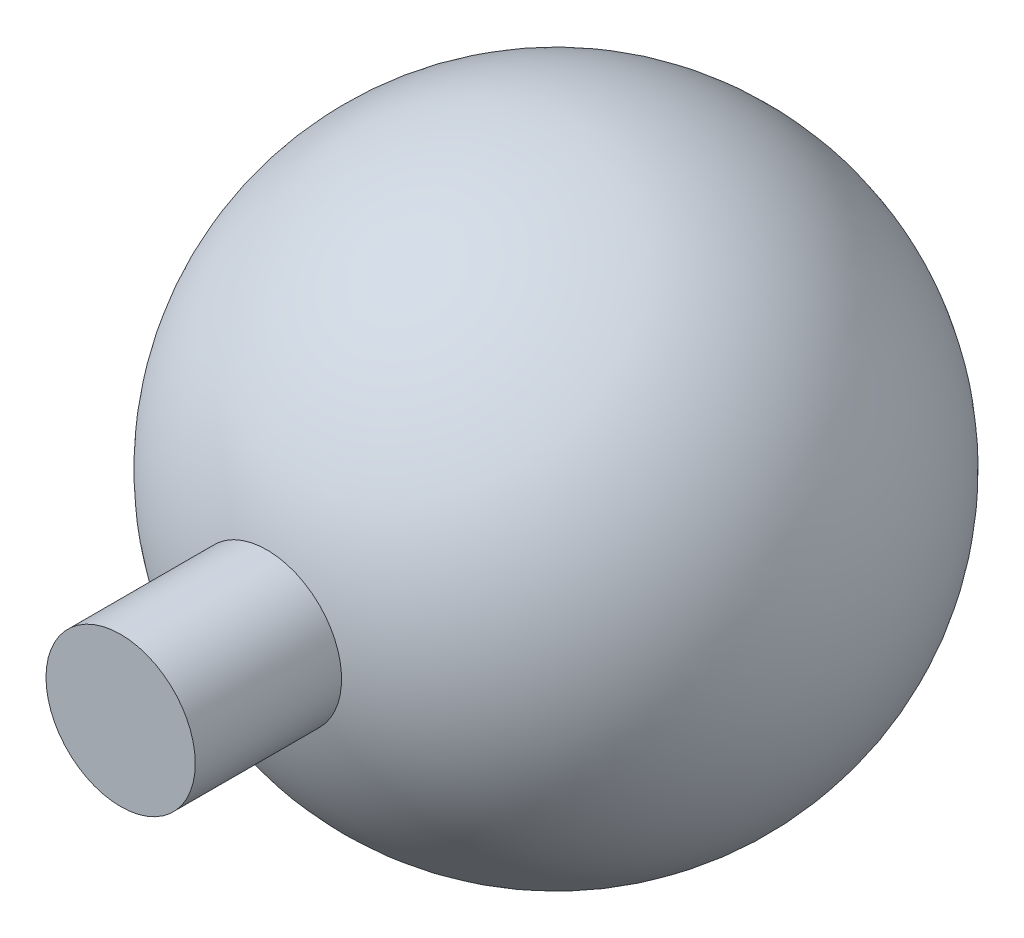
from build123d import *

# Parameters (mm, degrees)
ESQUISSE2_R      = 12
EXTRUSION1_DEPTH = 70


with BuildPart() as part:
    # Esquisse1 → R_volution1 (revolve)
    with BuildSketch(Plane.XY):
        with BuildLine():
            Line((0, 48), (0, -48))
            ThreePointArc((0, -48), (48, 0), (0, 48))
        make_face()
    revolve(axis=Axis((0, -69.048063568, 0), (0, 1, 0)))

    # Esquisse2 → Extrusion1 (add)
    with BuildSketch(Plane.XY):
        with Locations(Location((0, 0, 0), (0, 0, 180))):
            Circle(ESQUISSE2_R)
    extrude(amount=EXTRUSION1_DEPTH)


solid = part.part
